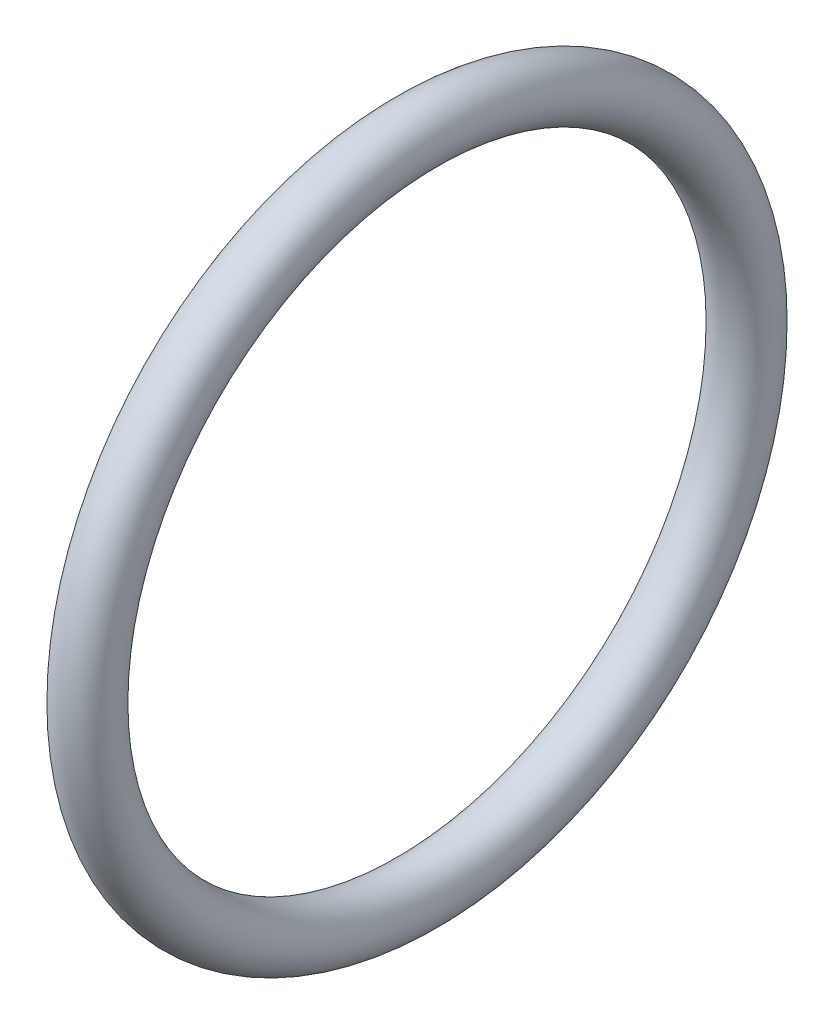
from build123d import *

# Parameters (mm, degrees)
SKETCH1_R = 1.143


with BuildPart() as part:
    # Sketch1 → Base-Revolve (revolve)
    with BuildSketch(Plane.XY, mode=Mode.PRIVATE) as base_revolve_sk:
        with Locations((1.143, 13.1445)):
            Circle(SKETCH1_R)
    revolve(base_revolve_sk.sketch.rotate(Axis((0, 0, 0), (1, 0, 0)), 90), axis=Axis((0, 0, 0), (1, 0, 0)))


solid = part.part
